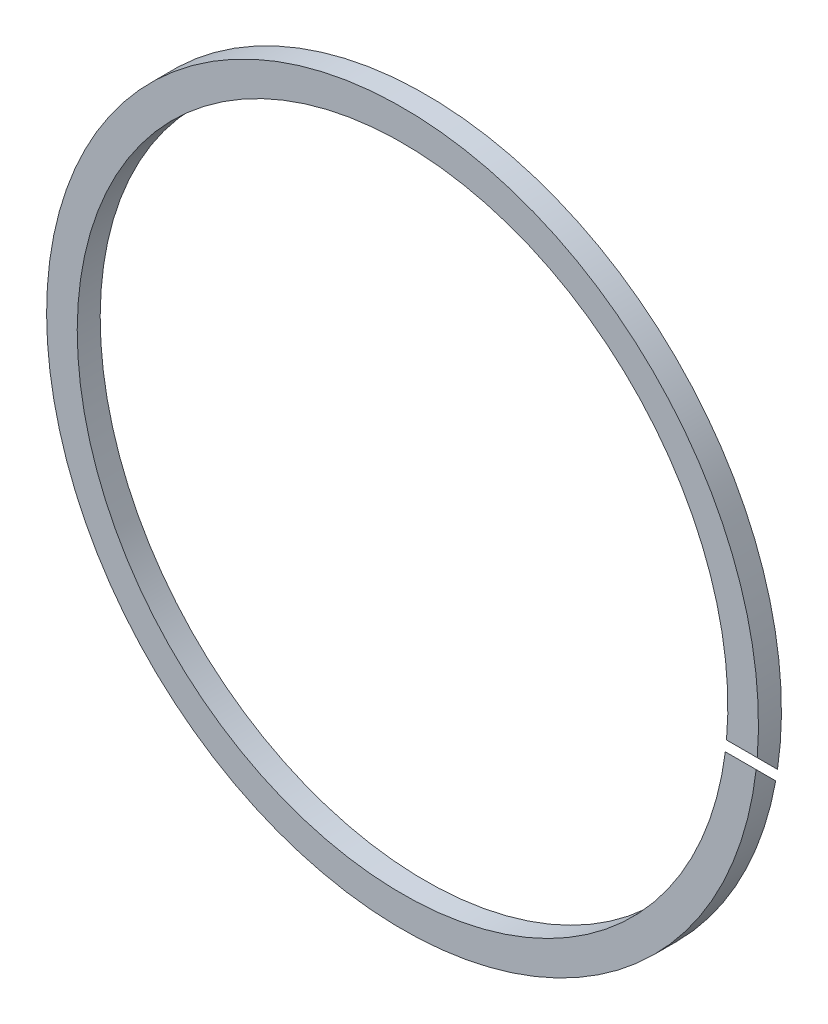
from build123d import *

# Parameters (mm, degrees)
SKETCH1_R               = 46.5
SKETCH1_R_2             = 42.5
EXTRUDE1_DEPTH          = 1.5
CUT_EXTRUDE_THIN2_REACH = 67.778


with BuildPart() as part:
    # Sketch1 → Extrude1 (new, symmetric)
    with BuildSketch(Plane.XY):
        Circle(SKETCH1_R)
        Circle(SKETCH1_R_2, mode=Mode.SUBTRACT)
    extrude(amount=EXTRUDE1_DEPTH, both=True)

    # Sketch3 → Cut-Extrude-Thin2 (cut, up to next)
    with BuildSketch(Plane(origin=(0, 0, 0), x_dir=(0, 0, -1), z_dir=(1, 0, 0)), mode=Mode.PRIVATE) as cut_extrude_thin2_sk1:
        Polygon((-3.449656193, -3.353553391), (2.742549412, -9.545758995), (3.449656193, -8.838652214), (-2.742549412, -2.646446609), align=None)
    cut_extrude_thin2_tool1 = extrude(cut_extrude_thin2_sk1.sketch, amount=CUT_EXTRUDE_THIN2_REACH, mode=Mode.PRIVATE) & part.part
    add(cut_extrude_thin2_tool1.solids().sort_by_distance((0, -6.096103, 0))[0], mode=Mode.SUBTRACT)


solid = part.part
